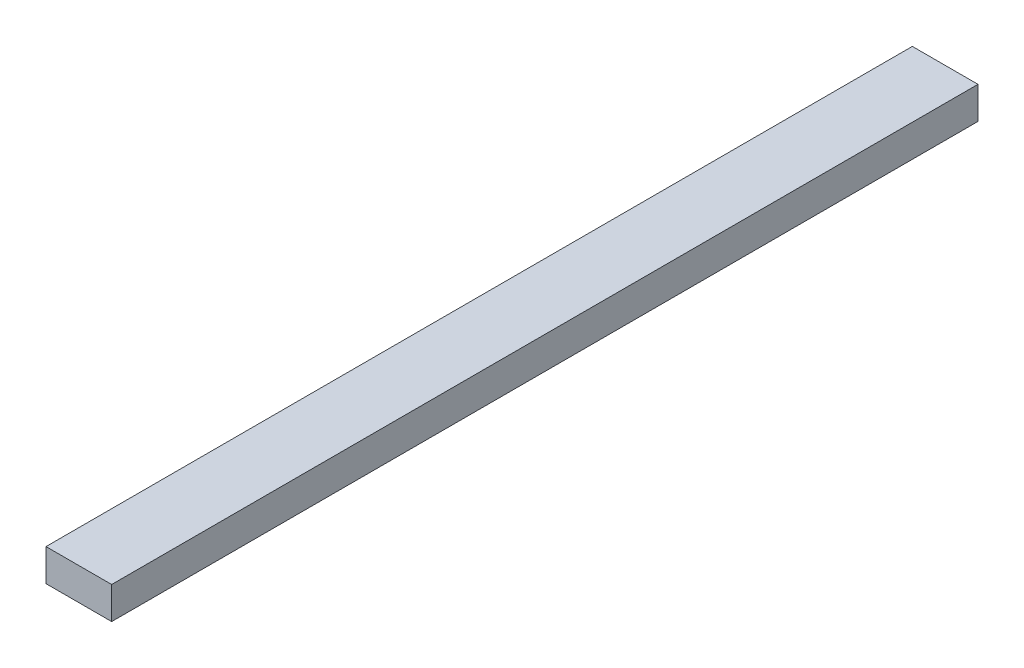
from build123d import *

# Parameters (mm, degrees)
ESQUISSE1_W        = 47
ESQUISSE1_H        = 23
BOSS_EXTRU_1_DEPTH = 620


with BuildPart() as part:
    # Esquisse1 → Boss.-Extru.1 (new body)
    with BuildSketch(Plane.XY):
        Rectangle(ESQUISSE1_W, ESQUISSE1_H)
    extrude(amount=BOSS_EXTRU_1_DEPTH)


solid = part.part
